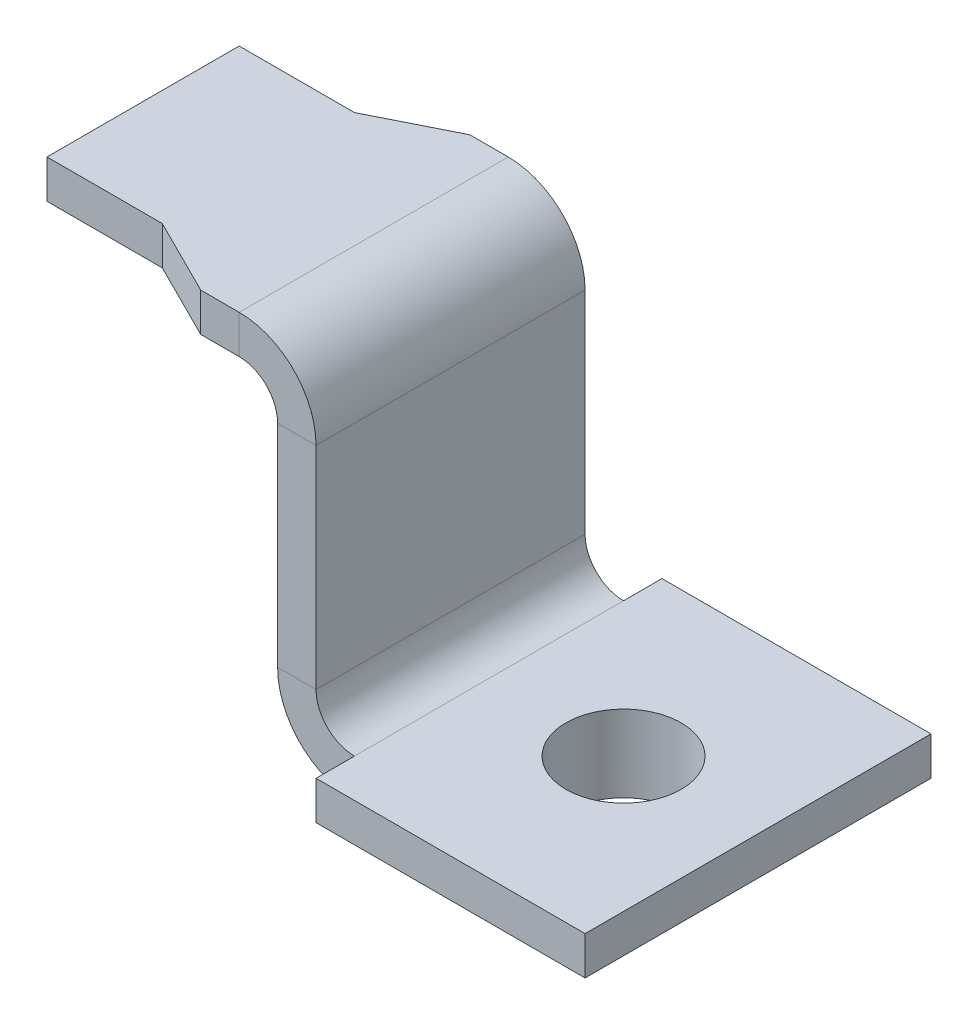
ISO-10303-21;
HEADER;
FILE_DESCRIPTION(('STEP AP214'),'2;1');
FILE_NAME('part.step','',(''),(''),'','','');
FILE_SCHEMA(('AUTOMOTIVE_DESIGN { 1 0 10303 214 1 1 1 1 }'));
ENDSEC;
DATA;
#1=APPLICATION_CONTEXT('core data for automotive mechanical design processes');
#2=APPLICATION_PROTOCOL_DEFINITION('international standard','automotive_design',2000,#1);
#3=PRODUCT_CONTEXT('',#1,'mechanical');
#4=PRODUCT('Part','Part','',(#3));
#5=PRODUCT_RELATED_PRODUCT_CATEGORY('part','',(#4));
#6=PRODUCT_DEFINITION_FORMATION('','',#4);
#7=PRODUCT_DEFINITION_CONTEXT('part definition',#1,'design');
#8=PRODUCT_DEFINITION('design','',#6,#7);
#9=PRODUCT_DEFINITION_SHAPE('','',#8);
#10=(LENGTH_UNIT() NAMED_UNIT(*) SI_UNIT(.MILLI.,.METRE.));
#11=(NAMED_UNIT(*) PLANE_ANGLE_UNIT() SI_UNIT($,.RADIAN.));
#12=(NAMED_UNIT(*) SI_UNIT($,.STERADIAN.) SOLID_ANGLE_UNIT());
#13=UNCERTAINTY_MEASURE_WITH_UNIT(LENGTH_MEASURE(1.E-05),#10,'distance_accuracy_value','');
#14=(GEOMETRIC_REPRESENTATION_CONTEXT(3) GLOBAL_UNCERTAINTY_ASSIGNED_CONTEXT((#13)) GLOBAL_UNIT_ASSIGNED_CONTEXT((#10,
#11,#12)) REPRESENTATION_CONTEXT('',''));
#15=CARTESIAN_POINT('',(0.,0.,0.));
#16=DIRECTION('',(0.,0.,1.));
#17=DIRECTION('',(1.,0.,0.));
#18=AXIS2_PLACEMENT_3D('',#15,#16,#17);
#19=CARTESIAN_POINT('',(-5.50000000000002,8.49999999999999,3.5));
#20=DIRECTION('',(0.,-1.,0.));
#21=DIRECTION('',(0.,0.,-1.));
#22=AXIS2_PLACEMENT_3D('',#19,#20,#21);
#23=PLANE('',#22);
#24=DIRECTION('',(-1.,0.,0.));
#25=VECTOR('',#24,1.);
#26=CARTESIAN_POINT('',(-5.50000000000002,8.49999999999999,3.5));
#27=LINE('',#26,#25);
#28=CARTESIAN_POINT('',(-7.50000000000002,8.49999999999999,3.5));
#29=VERTEX_POINT('',#28);
#30=CARTESIAN_POINT('',(-6.50000000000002,8.49999999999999,3.5));
#31=VERTEX_POINT('',#30);
#32=EDGE_CURVE('E223',#29,#31,#27,.F.);
#33=ORIENTED_EDGE('',*,*,#32,.F.);
#34=DIRECTION('',(0.894427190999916,0.,0.447213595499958));
#35=VECTOR('',#34,1.);
#36=CARTESIAN_POINT('',(-5.90000000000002,8.49999999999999,4.3));
#37=LINE('',#36,#35);
#38=CARTESIAN_POINT('',(-9.50000000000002,8.49999999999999,2.5));
#39=VERTEX_POINT('',#38);
#40=EDGE_CURVE('E83',#39,#29,#37,.T.);
#41=ORIENTED_EDGE('',*,*,#40,.F.);
#42=DIRECTION('',(1.,0.,0.));
#43=VECTOR('',#42,1.);
#44=CARTESIAN_POINT('',(-5.50000000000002,8.49999999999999,2.5));
#45=LINE('',#44,#43);
#46=CARTESIAN_POINT('',(-12.5,8.49999999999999,2.5));
#47=VERTEX_POINT('',#46);
#48=EDGE_CURVE('E198',#47,#39,#45,.T.);
#49=ORIENTED_EDGE('',*,*,#48,.F.);
#50=DIRECTION('',(0.,0.,-1.));
#51=VECTOR('',#50,1.);
#52=CARTESIAN_POINT('',(-12.5,8.49999999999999,3.5));
#53=LINE('',#52,#51);
#54=CARTESIAN_POINT('',(-12.5,8.49999999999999,-2.5));
#55=VERTEX_POINT('',#54);
#56=EDGE_CURVE('E212',#55,#47,#53,.F.);
#57=ORIENTED_EDGE('',*,*,#56,.F.);
#58=DIRECTION('',(-1.,0.,0.));
#59=VECTOR('',#58,1.);
#60=CARTESIAN_POINT('',(-5.50000000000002,8.49999999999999,-2.5));
#61=LINE('',#60,#59);
#62=CARTESIAN_POINT('',(-9.50000000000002,8.49999999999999,-2.5));
#63=VERTEX_POINT('',#62);
#64=EDGE_CURVE('E91',#63,#55,#61,.T.);
#65=ORIENTED_EDGE('',*,*,#64,.F.);
#66=DIRECTION('',(-0.894427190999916,0.,0.447213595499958));
#67=VECTOR('',#66,1.);
#68=CARTESIAN_POINT('',(-8.70000000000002,8.49999999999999,-2.9));
#69=LINE('',#68,#67);
#70=CARTESIAN_POINT('',(-7.50000000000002,8.49999999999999,-3.5));
#71=VERTEX_POINT('',#70);
#72=EDGE_CURVE('E449',#71,#63,#69,.T.);
#73=ORIENTED_EDGE('',*,*,#72,.F.);
#74=DIRECTION('',(1.,0.,0.));
#75=VECTOR('',#74,1.);
#76=CARTESIAN_POINT('',(-12.5,8.49999999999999,-3.5));
#77=LINE('',#76,#75);
#78=CARTESIAN_POINT('',(-6.50000000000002,8.49999999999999,-3.5));
#79=VERTEX_POINT('',#78);
#80=EDGE_CURVE('E218',#79,#71,#77,.F.);
#81=ORIENTED_EDGE('',*,*,#80,.F.);
#82=DIRECTION('',(0.,0.,-1.));
#83=VECTOR('',#82,1.);
#84=CARTESIAN_POINT('',(-6.50000000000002,8.49999999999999,3.5));
#85=LINE('',#84,#83);
#86=EDGE_CURVE('E234',#31,#79,#85,.T.);
#87=ORIENTED_EDGE('',*,*,#86,.F.);
#88=EDGE_LOOP('',(#33,#41,#49,#57,#65,#73,#81,#87));
#89=FACE_BOUND('',#88,.T.);
#90=CARTESIAN_POINT('',(-10.8,8.49999999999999,0.));
#91=DIRECTION('',(0.,-1.,0.));
#92=DIRECTION('',(0.,0.,-1.));
#93=AXIS2_PLACEMENT_3D('',#90,#91,#92);
#94=CIRCLE('',#93,1.5);
#95=CARTESIAN_POINT('',(-10.8,8.49999999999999,-1.5));
#96=VERTEX_POINT('',#95);
#97=EDGE_CURVE('E460',#96,#96,#94,.T.);
#98=ORIENTED_EDGE('',*,*,#97,.F.);
#99=EDGE_LOOP('',(#98));
#100=FACE_BOUND('',#99,.T.);
#101=ADVANCED_FACE('F68',(#89,#100),#23,.T.);
#102=CARTESIAN_POINT('',(-5.50000000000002,9.49999999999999,3.5));
#103=DIRECTION('',(0.,-1.,0.));
#104=DIRECTION('',(0.,0.,-1.));
#105=AXIS2_PLACEMENT_3D('',#102,#103,#104);
#106=PLANE('',#105);
#107=DIRECTION('',(0.894427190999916,0.,0.447213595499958));
#108=VECTOR('',#107,1.);
#109=CARTESIAN_POINT('',(-5.90000000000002,9.49999999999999,4.3));
#110=LINE('',#109,#108);
#111=CARTESIAN_POINT('',(-9.50000000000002,9.49999999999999,2.5));
#112=VERTEX_POINT('',#111);
#113=CARTESIAN_POINT('',(-7.50000000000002,9.49999999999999,3.5));
#114=VERTEX_POINT('',#113);
#115=EDGE_CURVE('E206',#112,#114,#110,.T.);
#116=ORIENTED_EDGE('',*,*,#115,.T.);
#117=DIRECTION('',(1.,0.,0.));
#118=VECTOR('',#117,1.);
#119=CARTESIAN_POINT('',(-5.50000000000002,9.49999999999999,3.5));
#120=LINE('',#119,#118);
#121=CARTESIAN_POINT('',(-6.50000000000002,9.49999999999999,3.5));
#122=VERTEX_POINT('',#121);
#123=EDGE_CURVE('E217',#114,#122,#120,.T.);
#124=ORIENTED_EDGE('',*,*,#123,.T.);
#125=DIRECTION('',(0.,0.,-1.));
#126=VECTOR('',#125,1.);
#127=CARTESIAN_POINT('',(-6.50000000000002,9.49999999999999,3.5));
#128=LINE('',#127,#126);
#129=CARTESIAN_POINT('',(-6.50000000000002,9.49999999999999,-3.5));
#130=VERTEX_POINT('',#129);
#131=EDGE_CURVE('E228',#130,#122,#128,.F.);
#132=ORIENTED_EDGE('',*,*,#131,.F.);
#133=DIRECTION('',(-1.,0.,0.));
#134=VECTOR('',#133,1.);
#135=CARTESIAN_POINT('',(-5.50000000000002,9.49999999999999,-3.5));
#136=LINE('',#135,#134);
#137=CARTESIAN_POINT('',(-7.50000000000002,9.49999999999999,-3.5));
#138=VERTEX_POINT('',#137);
#139=EDGE_CURVE('E220',#130,#138,#136,.T.);
#140=ORIENTED_EDGE('',*,*,#139,.T.);
#141=DIRECTION('',(-0.894427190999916,0.,0.447213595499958));
#142=VECTOR('',#141,1.);
#143=CARTESIAN_POINT('',(-8.70000000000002,9.49999999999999,-2.9));
#144=LINE('',#143,#142);
#145=CARTESIAN_POINT('',(-9.50000000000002,9.49999999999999,-2.5));
#146=VERTEX_POINT('',#145);
#147=EDGE_CURVE('E444',#138,#146,#144,.T.);
#148=ORIENTED_EDGE('',*,*,#147,.T.);
#149=DIRECTION('',(1.,0.,0.));
#150=VECTOR('',#149,1.);
#151=CARTESIAN_POINT('',(-5.50000000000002,9.49999999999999,-2.5));
#152=LINE('',#151,#150);
#153=CARTESIAN_POINT('',(-12.5,9.49999999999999,-2.5));
#154=VERTEX_POINT('',#153);
#155=EDGE_CURVE('E440',#146,#154,#152,.F.);
#156=ORIENTED_EDGE('',*,*,#155,.T.);
#157=DIRECTION('',(0.,0.,1.));
#158=VECTOR('',#157,1.);
#159=CARTESIAN_POINT('',(-12.5,9.49999999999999,3.5));
#160=LINE('',#159,#158);
#161=CARTESIAN_POINT('',(-12.5,9.49999999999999,2.5));
#162=VERTEX_POINT('',#161);
#163=EDGE_CURVE('E247',#154,#162,#160,.T.);
#164=ORIENTED_EDGE('',*,*,#163,.T.);
#165=DIRECTION('',(1.,0.,0.));
#166=VECTOR('',#165,1.);
#167=CARTESIAN_POINT('',(-5.50000000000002,9.49999999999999,2.5));
#168=LINE('',#167,#166);
#169=EDGE_CURVE('E200',#162,#112,#168,.T.);
#170=ORIENTED_EDGE('',*,*,#169,.T.);
#171=EDGE_LOOP('',(#116,#124,#132,#140,#148,#156,#164,#170));
#172=FACE_BOUND('',#171,.T.);
#173=ADVANCED_FACE('F466',(#172),#106,.F.);
#174=CARTESIAN_POINT('',(-12.5,9.49999999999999,3.5));
#175=DIRECTION('',(1.,0.,0.));
#176=DIRECTION('',(0.,1.,0.));
#177=AXIS2_PLACEMENT_3D('',#174,#175,#176);
#178=PLANE('',#177);
#179=DIRECTION('',(0.,-1.,0.));
#180=VECTOR('',#179,1.);
#181=CARTESIAN_POINT('',(-12.5,8.49999999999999,2.5));
#182=LINE('',#181,#180);
#183=EDGE_CURVE('E194',#47,#162,#182,.F.);
#184=ORIENTED_EDGE('',*,*,#183,.T.);
#185=ORIENTED_EDGE('',*,*,#163,.F.);
#186=DIRECTION('',(0.,-1.,0.));
#187=VECTOR('',#186,1.);
#188=CARTESIAN_POINT('',(-12.5,8.49999999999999,-2.5));
#189=LINE('',#188,#187);
#190=EDGE_CURVE('E216',#55,#154,#189,.F.);
#191=ORIENTED_EDGE('',*,*,#190,.F.);
#192=ORIENTED_EDGE('',*,*,#56,.T.);
#193=EDGE_LOOP('',(#184,#185,#191,#192));
#194=FACE_BOUND('',#193,.T.);
#195=ADVANCED_FACE('F215',(#194),#178,.F.);
#196=CARTESIAN_POINT('',(-5.50000000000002,9.49999999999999,3.5));
#197=DIRECTION('',(0.,0.,-1.));
#198=DIRECTION('',(-1.,0.,0.));
#199=AXIS2_PLACEMENT_3D('',#196,#197,#198);
#200=PLANE('',#199);
#201=DIRECTION('',(0.,-1.,0.));
#202=VECTOR('',#201,1.);
#203=CARTESIAN_POINT('',(-7.50000000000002,8.49999999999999,3.5));
#204=LINE('',#203,#202);
#205=EDGE_CURVE('E205',#29,#114,#204,.F.);
#206=ORIENTED_EDGE('',*,*,#205,.F.);
#207=ORIENTED_EDGE('',*,*,#32,.T.);
#208=DIRECTION('',(0.,-1.,0.));
#209=VECTOR('',#208,1.);
#210=CARTESIAN_POINT('',(-6.50000000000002,9.49999999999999,3.5));
#211=LINE('',#210,#209);
#212=EDGE_CURVE('E236',#31,#122,#211,.F.);
#213=ORIENTED_EDGE('',*,*,#212,.T.);
#214=ORIENTED_EDGE('',*,*,#123,.F.);
#215=EDGE_LOOP('',(#206,#207,#213,#214));
#216=FACE_BOUND('',#215,.T.);
#217=ADVANCED_FACE('F412',(#216),#200,.F.);
#218=CARTESIAN_POINT('',(-12.5,9.49999999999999,-3.5));
#219=DIRECTION('',(0.,0.,1.));
#220=DIRECTION('',(1.,0.,0.));
#221=AXIS2_PLACEMENT_3D('',#218,#219,#220);
#222=PLANE('',#221);
#223=DIRECTION('',(0.,-1.,0.));
#224=VECTOR('',#223,1.);
#225=CARTESIAN_POINT('',(-7.50000000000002,8.49999999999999,-3.5));
#226=LINE('',#225,#224);
#227=EDGE_CURVE('E425',#71,#138,#226,.F.);
#228=ORIENTED_EDGE('',*,*,#227,.T.);
#229=ORIENTED_EDGE('',*,*,#139,.F.);
#230=DIRECTION('',(0.,-1.,0.));
#231=VECTOR('',#230,1.);
#232=CARTESIAN_POINT('',(-6.50000000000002,8.49999999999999,-3.5));
#233=LINE('',#232,#231);
#234=EDGE_CURVE('E231',#79,#130,#233,.F.);
#235=ORIENTED_EDGE('',*,*,#234,.F.);
#236=ORIENTED_EDGE('',*,*,#80,.T.);
#237=EDGE_LOOP('',(#228,#229,#235,#236));
#238=FACE_BOUND('',#237,.T.);
#239=ADVANCED_FACE('F423',(#238),#222,.F.);
#240=CARTESIAN_POINT('',(-3.5,0.,4.5));
#241=DIRECTION('',(0.,1.,0.));
#242=DIRECTION('',(0.,0.,1.));
#243=AXIS2_PLACEMENT_3D('',#240,#241,#242);
#244=PLANE('',#243);
#245=CARTESIAN_POINT('',(0.,0.,0.));
#246=DIRECTION('',(0.,1.,0.));
#247=DIRECTION('',(0.,0.,1.));
#248=AXIS2_PLACEMENT_3D('',#245,#246,#247);
#249=CIRCLE('',#248,3.);
#250=CARTESIAN_POINT('',(0.,0.,3.));
#251=VERTEX_POINT('',#250);
#252=EDGE_CURVE('E13',#251,#251,#249,.T.);
#253=ORIENTED_EDGE('',*,*,#252,.T.);
#254=EDGE_LOOP('',(#253));
#255=FACE_BOUND('',#254,.T.);
#256=DIRECTION('',(0.,0.,1.));
#257=VECTOR('',#256,1.);
#258=CARTESIAN_POINT('',(-3.5,0.,-4.5));
#259=LINE('',#258,#257);
#260=CARTESIAN_POINT('',(-3.5,0.,-4.5));
#261=VERTEX_POINT('',#260);
#262=CARTESIAN_POINT('',(-3.5,0.,-3.5));
#263=VERTEX_POINT('',#262);
#264=EDGE_CURVE('E324',#261,#263,#259,.T.);
#265=ORIENTED_EDGE('',*,*,#264,.F.);
#266=DIRECTION('',(-1.,0.,0.));
#267=VECTOR('',#266,1.);
#268=CARTESIAN_POINT('',(-3.5,0.,-4.5));
#269=LINE('',#268,#267);
#270=CARTESIAN_POINT('',(3.5,0.,-4.5));
#271=VERTEX_POINT('',#270);
#272=EDGE_CURVE('E335',#271,#261,#269,.T.);
#273=ORIENTED_EDGE('',*,*,#272,.F.);
#274=DIRECTION('',(0.,0.,-1.));
#275=VECTOR('',#274,1.);
#276=CARTESIAN_POINT('',(3.5,0.,-4.5));
#277=LINE('',#276,#275);
#278=CARTESIAN_POINT('',(3.5,0.,4.5));
#279=VERTEX_POINT('',#278);
#280=EDGE_CURVE('E333',#279,#271,#277,.T.);
#281=ORIENTED_EDGE('',*,*,#280,.F.);
#282=DIRECTION('',(1.,0.,0.));
#283=VECTOR('',#282,1.);
#284=CARTESIAN_POINT('',(-3.5,0.,4.5));
#285=LINE('',#284,#283);
#286=CARTESIAN_POINT('',(-3.5,0.,4.5));
#287=VERTEX_POINT('',#286);
#288=EDGE_CURVE('E327',#287,#279,#285,.T.);
#289=ORIENTED_EDGE('',*,*,#288,.F.);
#290=CARTESIAN_POINT('',(-3.5,0.,3.5));
#291=VERTEX_POINT('',#290);
#292=EDGE_CURVE('E293',#291,#287,#259,.T.);
#293=ORIENTED_EDGE('',*,*,#292,.F.);
#294=DIRECTION('',(0.,0.,1.));
#295=VECTOR('',#294,1.);
#296=CARTESIAN_POINT('',(-3.5,0.,3.5));
#297=LINE('',#296,#295);
#298=EDGE_CURVE('E307',#291,#263,#297,.F.);
#299=ORIENTED_EDGE('',*,*,#298,.T.);
#300=EDGE_LOOP('',(#265,#273,#281,#289,#293,#299));
#301=FACE_BOUND('',#300,.T.);
#302=ADVANCED_FACE('F364',(#255,#301),#244,.F.);
#303=CARTESIAN_POINT('',(-3.5,1.,-4.5));
#304=DIRECTION('',(1.,0.,0.));
#305=DIRECTION('',(0.,0.,-1.));
#306=AXIS2_PLACEMENT_3D('',#303,#304,#305);
#307=PLANE('',#306);
#308=DIRECTION('',(0.,-1.,0.));
#309=VECTOR('',#308,1.);
#310=CARTESIAN_POINT('',(-3.5,0.999999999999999,-3.5));
#311=LINE('',#310,#309);
#312=CARTESIAN_POINT('',(-3.5,0.999999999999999,-3.5));
#313=VERTEX_POINT('',#312);
#314=EDGE_CURVE('E290',#313,#263,#311,.T.);
#315=ORIENTED_EDGE('',*,*,#314,.F.);
#316=DIRECTION('',(0.,0.,1.));
#317=VECTOR('',#316,1.);
#318=CARTESIAN_POINT('',(-3.5,1.,-4.5));
#319=LINE('',#318,#317);
#320=CARTESIAN_POINT('',(-3.5,1.,-4.5));
#321=VERTEX_POINT('',#320);
#322=EDGE_CURVE('E345',#321,#313,#319,.T.);
#323=ORIENTED_EDGE('',*,*,#322,.F.);
#324=DIRECTION('',(0.,-1.,0.));
#325=VECTOR('',#324,1.);
#326=CARTESIAN_POINT('',(-3.5,1.,-4.5));
#327=LINE('',#326,#325);
#328=EDGE_CURVE('E372',#321,#261,#327,.T.);
#329=ORIENTED_EDGE('',*,*,#328,.T.);
#330=ORIENTED_EDGE('',*,*,#264,.T.);
#331=EDGE_LOOP('',(#315,#323,#329,#330));
#332=FACE_BOUND('',#331,.T.);
#333=ADVANCED_FACE('F382',(#332),#307,.F.);
#334=CARTESIAN_POINT('',(-3.5,0.999999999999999,3.5));
#335=VERTEX_POINT('',#334);
#336=CARTESIAN_POINT('',(-3.5,1.,4.5));
#337=VERTEX_POINT('',#336);
#338=EDGE_CURVE('E337',#335,#337,#319,.T.);
#339=ORIENTED_EDGE('',*,*,#338,.F.);
#340=DIRECTION('',(0.,-1.,0.));
#341=VECTOR('',#340,1.);
#342=CARTESIAN_POINT('',(-3.5,0.999999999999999,3.5));
#343=LINE('',#342,#341);
#344=EDGE_CURVE('E294',#335,#291,#343,.T.);
#345=ORIENTED_EDGE('',*,*,#344,.T.);
#346=ORIENTED_EDGE('',*,*,#292,.T.);
#347=DIRECTION('',(0.,-1.,0.));
#348=VECTOR('',#347,1.);
#349=CARTESIAN_POINT('',(-3.5,1.,4.5));
#350=LINE('',#349,#348);
#351=EDGE_CURVE('E310',#337,#287,#350,.T.);
#352=ORIENTED_EDGE('',*,*,#351,.F.);
#353=EDGE_LOOP('',(#339,#345,#346,#352));
#354=FACE_BOUND('',#353,.T.);
#355=ADVANCED_FACE('F70',(#354),#307,.F.);
#356=CARTESIAN_POINT('',(-3.5,1.,4.5));
#357=DIRECTION('',(0.,0.,-1.));
#358=DIRECTION('',(-1.,0.,0.));
#359=AXIS2_PLACEMENT_3D('',#356,#357,#358);
#360=PLANE('',#359);
#361=ORIENTED_EDGE('',*,*,#288,.T.);
#362=DIRECTION('',(0.,-1.,0.));
#363=VECTOR('',#362,1.);
#364=CARTESIAN_POINT('',(3.5,1.,4.5));
#365=LINE('',#364,#363);
#366=CARTESIAN_POINT('',(3.5,1.,4.5));
#367=VERTEX_POINT('',#366);
#368=EDGE_CURVE('E314',#367,#279,#365,.T.);
#369=ORIENTED_EDGE('',*,*,#368,.F.);
#370=DIRECTION('',(1.,0.,0.));
#371=VECTOR('',#370,1.);
#372=CARTESIAN_POINT('',(-3.5,1.,4.5));
#373=LINE('',#372,#371);
#374=EDGE_CURVE('E340',#337,#367,#373,.T.);
#375=ORIENTED_EDGE('',*,*,#374,.F.);
#376=ORIENTED_EDGE('',*,*,#351,.T.);
#377=EDGE_LOOP('',(#361,#369,#375,#376));
#378=FACE_BOUND('',#377,.T.);
#379=ADVANCED_FACE('F356',(#378),#360,.F.);
#380=CARTESIAN_POINT('',(3.5,1.,-4.5));
#381=DIRECTION('',(-1.,0.,0.));
#382=DIRECTION('',(0.,0.,1.));
#383=AXIS2_PLACEMENT_3D('',#380,#381,#382);
#384=PLANE('',#383);
#385=ORIENTED_EDGE('',*,*,#280,.T.);
#386=DIRECTION('',(0.,-1.,0.));
#387=VECTOR('',#386,1.);
#388=CARTESIAN_POINT('',(3.5,1.,-4.5));
#389=LINE('',#388,#387);
#390=CARTESIAN_POINT('',(3.5,1.,-4.5));
#391=VERTEX_POINT('',#390);
#392=EDGE_CURVE('E320',#391,#271,#389,.T.);
#393=ORIENTED_EDGE('',*,*,#392,.F.);
#394=DIRECTION('',(0.,0.,-1.));
#395=VECTOR('',#394,1.);
#396=CARTESIAN_POINT('',(3.5,1.,-4.5));
#397=LINE('',#396,#395);
#398=EDGE_CURVE('E350',#367,#391,#397,.T.);
#399=ORIENTED_EDGE('',*,*,#398,.F.);
#400=ORIENTED_EDGE('',*,*,#368,.T.);
#401=EDGE_LOOP('',(#385,#393,#399,#400));
#402=FACE_BOUND('',#401,.T.);
#403=ADVANCED_FACE('F367',(#402),#384,.F.);
#404=CARTESIAN_POINT('',(-3.5,1.,-4.5));
#405=DIRECTION('',(0.,0.,1.));
#406=DIRECTION('',(1.,0.,0.));
#407=AXIS2_PLACEMENT_3D('',#404,#405,#406);
#408=PLANE('',#407);
#409=ORIENTED_EDGE('',*,*,#272,.T.);
#410=ORIENTED_EDGE('',*,*,#328,.F.);
#411=DIRECTION('',(-1.,0.,0.));
#412=VECTOR('',#411,1.);
#413=CARTESIAN_POINT('',(-3.5,1.,-4.5));
#414=LINE('',#413,#412);
#415=EDGE_CURVE('E371',#391,#321,#414,.T.);
#416=ORIENTED_EDGE('',*,*,#415,.F.);
#417=ORIENTED_EDGE('',*,*,#392,.T.);
#418=EDGE_LOOP('',(#409,#410,#416,#417));
#419=FACE_BOUND('',#418,.T.);
#420=ADVANCED_FACE('F377',(#419),#408,.F.);
#421=CARTESIAN_POINT('',(-3.5,1.,4.5));
#422=DIRECTION('',(0.,1.,0.));
#423=DIRECTION('',(0.,0.,1.));
#424=AXIS2_PLACEMENT_3D('',#421,#422,#423);
#425=PLANE('',#424);
#426=CARTESIAN_POINT('',(0.,1.,0.));
#427=DIRECTION('',(0.,1.,0.));
#428=DIRECTION('',(0.,0.,1.));
#429=AXIS2_PLACEMENT_3D('',#426,#427,#428);
#430=CIRCLE('',#429,1.5);
#431=CARTESIAN_POINT('',(0.,1.,1.5));
#432=VERTEX_POINT('',#431);
#433=EDGE_CURVE('E239',#432,#432,#430,.T.);
#434=ORIENTED_EDGE('',*,*,#433,.F.);
#435=EDGE_LOOP('',(#434));
#436=FACE_BOUND('',#435,.T.);
#437=ORIENTED_EDGE('',*,*,#322,.T.);
#438=DIRECTION('',(0.,0.,1.));
#439=VECTOR('',#438,1.);
#440=CARTESIAN_POINT('',(-3.5,0.999999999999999,3.5));
#441=LINE('',#440,#439);
#442=EDGE_CURVE('E301',#335,#313,#441,.F.);
#443=ORIENTED_EDGE('',*,*,#442,.F.);
#444=ORIENTED_EDGE('',*,*,#338,.T.);
#445=ORIENTED_EDGE('',*,*,#374,.T.);
#446=ORIENTED_EDGE('',*,*,#398,.T.);
#447=ORIENTED_EDGE('',*,*,#415,.T.);
#448=EDGE_LOOP('',(#437,#443,#444,#445,#446,#447));
#449=FACE_BOUND('',#448,.T.);
#450=ADVANCED_FACE('F352',(#436,#449),#425,.T.);
#451=CARTESIAN_POINT('',(-3.5,2.,-3.5));
#452=DIRECTION('',(0.,0.,-1.));
#453=DIRECTION('',(-1.,0.,0.));
#454=AXIS2_PLACEMENT_3D('',#451,#452,#453);
#455=PLANE('',#454);
#456=DIRECTION('',(1.,0.,0.));
#457=VECTOR('',#456,1.);
#458=CARTESIAN_POINT('',(-5.5,1.99999999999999,-3.5));
#459=LINE('',#458,#457);
#460=CARTESIAN_POINT('',(-4.5,2.,-3.5));
#461=VERTEX_POINT('',#460);
#462=CARTESIAN_POINT('',(-5.5,1.99999999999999,-3.5));
#463=VERTEX_POINT('',#462);
#464=EDGE_CURVE('E251',#461,#463,#459,.F.);
#465=ORIENTED_EDGE('',*,*,#464,.F.);
#466=CARTESIAN_POINT('',(-3.5,2.,-3.5));
#467=DIRECTION('',(0.,0.,1.));
#468=DIRECTION('',(1.,0.,0.));
#469=AXIS2_PLACEMENT_3D('',#466,#467,#468);
#470=CIRCLE('',#469,1.);
#471=EDGE_CURVE('E297',#313,#461,#470,.F.);
#472=ORIENTED_EDGE('',*,*,#471,.F.);
#473=ORIENTED_EDGE('',*,*,#314,.T.);
#474=CARTESIAN_POINT('',(-3.5,2.,-3.5));
#475=DIRECTION('',(0.,0.,1.));
#476=DIRECTION('',(1.,0.,0.));
#477=AXIS2_PLACEMENT_3D('',#474,#475,#476);
#478=CIRCLE('',#477,2.);
#479=EDGE_CURVE('E304',#263,#463,#478,.F.);
#480=ORIENTED_EDGE('',*,*,#479,.T.);
#481=EDGE_LOOP('',(#465,#472,#473,#480));
#482=FACE_BOUND('',#481,.T.);
#483=ADVANCED_FACE('F386',(#482),#455,.T.);
#484=CARTESIAN_POINT('',(-3.5,2.,3.5));
#485=DIRECTION('',(0.,0.,-1.));
#486=DIRECTION('',(-1.,0.,0.));
#487=AXIS2_PLACEMENT_3D('',#484,#485,#486);
#488=PLANE('',#487);
#489=CARTESIAN_POINT('',(-3.5,2.,3.5));
#490=DIRECTION('',(0.,0.,1.));
#491=DIRECTION('',(1.,0.,0.));
#492=AXIS2_PLACEMENT_3D('',#489,#490,#491);
#493=CIRCLE('',#492,1.);
#494=CARTESIAN_POINT('',(-4.5,2.,3.5));
#495=VERTEX_POINT('',#494);
#496=EDGE_CURVE('E257',#495,#335,#493,.T.);
#497=ORIENTED_EDGE('',*,*,#496,.F.);
#498=DIRECTION('',(1.,0.,0.));
#499=VECTOR('',#498,1.);
#500=CARTESIAN_POINT('',(-4.5,2.,3.5));
#501=LINE('',#500,#499);
#502=CARTESIAN_POINT('',(-5.5,1.99999999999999,3.5));
#503=VERTEX_POINT('',#502);
#504=EDGE_CURVE('E278',#495,#503,#501,.F.);
#505=ORIENTED_EDGE('',*,*,#504,.T.);
#506=CARTESIAN_POINT('',(-3.5,2.,3.5));
#507=DIRECTION('',(0.,0.,1.));
#508=DIRECTION('',(1.,0.,0.));
#509=AXIS2_PLACEMENT_3D('',#506,#507,#508);
#510=CIRCLE('',#509,2.);
#511=EDGE_CURVE('E300',#503,#291,#510,.T.);
#512=ORIENTED_EDGE('',*,*,#511,.T.);
#513=ORIENTED_EDGE('',*,*,#344,.F.);
#514=EDGE_LOOP('',(#497,#505,#512,#513));
#515=FACE_BOUND('',#514,.T.);
#516=ADVANCED_FACE('F510',(#515),#488,.F.);
#517=CARTESIAN_POINT('',(-3.5,2.,3.5));
#518=DIRECTION('',(0.,0.,1.));
#519=DIRECTION('',(-1.,0.,0.));
#520=AXIS2_PLACEMENT_3D('',#517,#518,#519);
#521=CYLINDRICAL_SURFACE('',#520,2.);
#522=ORIENTED_EDGE('',*,*,#298,.F.);
#523=ORIENTED_EDGE('',*,*,#511,.F.);
#524=DIRECTION('',(0.,0.,1.));
#525=VECTOR('',#524,1.);
#526=CARTESIAN_POINT('',(-5.5,1.99999999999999,-3.5));
#527=LINE('',#526,#525);
#528=EDGE_CURVE('E276',#503,#463,#527,.F.);
#529=ORIENTED_EDGE('',*,*,#528,.T.);
#530=ORIENTED_EDGE('',*,*,#479,.F.);
#531=EDGE_LOOP('',(#522,#523,#529,#530));
#532=FACE_BOUND('',#531,.T.);
#533=ADVANCED_FACE('F388',(#532),#521,.T.);
#534=CARTESIAN_POINT('',(-3.5,2.,3.5));
#535=DIRECTION('',(0.,0.,1.));
#536=DIRECTION('',(-1.,0.,0.));
#537=AXIS2_PLACEMENT_3D('',#534,#535,#536);
#538=CYLINDRICAL_SURFACE('',#537,1.);
#539=ORIENTED_EDGE('',*,*,#442,.T.);
#540=ORIENTED_EDGE('',*,*,#471,.T.);
#541=DIRECTION('',(0.,0.,1.));
#542=VECTOR('',#541,1.);
#543=CARTESIAN_POINT('',(-4.5,2.,-3.5));
#544=LINE('',#543,#542);
#545=EDGE_CURVE('E281',#461,#495,#544,.T.);
#546=ORIENTED_EDGE('',*,*,#545,.T.);
#547=ORIENTED_EDGE('',*,*,#496,.T.);
#548=EDGE_LOOP('',(#539,#540,#546,#547));
#549=FACE_BOUND('',#548,.T.);
#550=ADVANCED_FACE('F505',(#549),#538,.F.);
#551=CARTESIAN_POINT('',(-5.5,0.999999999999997,-3.5));
#552=DIRECTION('',(0.,0.,1.));
#553=DIRECTION('',(1.,0.,0.));
#554=AXIS2_PLACEMENT_3D('',#551,#552,#553);
#555=PLANE('',#554);
#556=ORIENTED_EDGE('',*,*,#464,.T.);
#557=DIRECTION('',(0.,-1.,0.));
#558=VECTOR('',#557,1.);
#559=CARTESIAN_POINT('',(-5.5,0.999999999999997,-3.5));
#560=LINE('',#559,#558);
#561=CARTESIAN_POINT('',(-5.50000000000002,7.5,-3.5));
#562=VERTEX_POINT('',#561);
#563=EDGE_CURVE('E265',#562,#463,#560,.T.);
#564=ORIENTED_EDGE('',*,*,#563,.F.);
#565=DIRECTION('',(1.,0.,0.));
#566=VECTOR('',#565,1.);
#567=CARTESIAN_POINT('',(-5.50000000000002,7.5,-3.5));
#568=LINE('',#567,#566);
#569=CARTESIAN_POINT('',(-4.50000000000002,7.5,-3.5));
#570=VERTEX_POINT('',#569);
#571=EDGE_CURVE('E258',#562,#570,#568,.T.);
#572=ORIENTED_EDGE('',*,*,#571,.T.);
#573=DIRECTION('',(0.,1.,0.));
#574=VECTOR('',#573,1.);
#575=CARTESIAN_POINT('',(-4.5,1.,-3.5));
#576=LINE('',#575,#574);
#577=EDGE_CURVE('E273',#570,#461,#576,.F.);
#578=ORIENTED_EDGE('',*,*,#577,.T.);
#579=EDGE_LOOP('',(#556,#564,#572,#578));
#580=FACE_BOUND('',#579,.T.);
#581=ADVANCED_FACE('F502',(#580),#555,.F.);
#582=CARTESIAN_POINT('',(-5.50000000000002,7.5,3.5));
#583=DIRECTION('',(0.,0.,-1.));
#584=DIRECTION('',(-1.,0.,0.));
#585=AXIS2_PLACEMENT_3D('',#582,#583,#584);
#586=PLANE('',#585);
#587=ORIENTED_EDGE('',*,*,#504,.F.);
#588=DIRECTION('',(0.,-1.,0.));
#589=VECTOR('',#588,1.);
#590=CARTESIAN_POINT('',(-4.50000000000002,7.5,3.5));
#591=LINE('',#590,#589);
#592=CARTESIAN_POINT('',(-4.50000000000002,7.5,3.5));
#593=VERTEX_POINT('',#592);
#594=EDGE_CURVE('E271',#495,#593,#591,.F.);
#595=ORIENTED_EDGE('',*,*,#594,.T.);
#596=DIRECTION('',(1.,0.,0.));
#597=VECTOR('',#596,1.);
#598=CARTESIAN_POINT('',(-5.50000000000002,7.5,3.5));
#599=LINE('',#598,#597);
#600=CARTESIAN_POINT('',(-5.50000000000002,7.5,3.5));
#601=VERTEX_POINT('',#600);
#602=EDGE_CURVE('E254',#601,#593,#599,.T.);
#603=ORIENTED_EDGE('',*,*,#602,.F.);
#604=DIRECTION('',(0.,1.,0.));
#605=VECTOR('',#604,1.);
#606=CARTESIAN_POINT('',(-5.5,0.999999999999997,3.5));
#607=LINE('',#606,#605);
#608=EDGE_CURVE('E263',#503,#601,#607,.T.);
#609=ORIENTED_EDGE('',*,*,#608,.F.);
#610=EDGE_LOOP('',(#587,#595,#603,#609));
#611=FACE_BOUND('',#610,.T.);
#612=ADVANCED_FACE('F397',(#611),#586,.F.);
#613=CARTESIAN_POINT('',(-5.5,0.999999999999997,-3.5));
#614=DIRECTION('',(1.,0.,0.));
#615=DIRECTION('',(0.,1.,0.));
#616=AXIS2_PLACEMENT_3D('',#613,#614,#615);
#617=PLANE('',#616);
#618=ORIENTED_EDGE('',*,*,#528,.F.);
#619=ORIENTED_EDGE('',*,*,#608,.T.);
#620=DIRECTION('',(0.,0.,-1.));
#621=VECTOR('',#620,1.);
#622=CARTESIAN_POINT('',(-5.50000000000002,7.5,-3.5));
#623=LINE('',#622,#621);
#624=EDGE_CURVE('E261',#601,#562,#623,.T.);
#625=ORIENTED_EDGE('',*,*,#624,.T.);
#626=ORIENTED_EDGE('',*,*,#563,.T.);
#627=EDGE_LOOP('',(#618,#619,#625,#626));
#628=FACE_BOUND('',#627,.T.);
#629=ADVANCED_FACE('F392',(#628),#617,.F.);
#630=CARTESIAN_POINT('',(-4.5,1.,-3.5));
#631=DIRECTION('',(1.,0.,0.));
#632=DIRECTION('',(0.,1.,0.));
#633=AXIS2_PLACEMENT_3D('',#630,#631,#632);
#634=PLANE('',#633);
#635=ORIENTED_EDGE('',*,*,#594,.F.);
#636=ORIENTED_EDGE('',*,*,#545,.F.);
#637=ORIENTED_EDGE('',*,*,#577,.F.);
#638=DIRECTION('',(0.,0.,1.));
#639=VECTOR('',#638,1.);
#640=CARTESIAN_POINT('',(-4.50000000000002,7.5,-3.5));
#641=LINE('',#640,#639);
#642=EDGE_CURVE('E268',#593,#570,#641,.F.);
#643=ORIENTED_EDGE('',*,*,#642,.F.);
#644=EDGE_LOOP('',(#635,#636,#637,#643));
#645=FACE_BOUND('',#644,.T.);
#646=ADVANCED_FACE('F492',(#645),#634,.T.);
#647=CARTESIAN_POINT('',(-6.50000000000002,7.49999999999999,3.5));
#648=DIRECTION('',(0.,0.,1.));
#649=DIRECTION('',(1.,0.,0.));
#650=AXIS2_PLACEMENT_3D('',#647,#648,#649);
#651=PLANE('',#650);
#652=ORIENTED_EDGE('',*,*,#212,.F.);
#653=CARTESIAN_POINT('',(-6.50000000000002,7.49999999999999,3.5));
#654=DIRECTION('',(0.,0.,-1.));
#655=DIRECTION('',(-1.,0.,0.));
#656=AXIS2_PLACEMENT_3D('',#653,#654,#655);
#657=CIRCLE('',#656,1.);
#658=EDGE_CURVE('E240',#601,#31,#657,.F.);
#659=ORIENTED_EDGE('',*,*,#658,.F.);
#660=ORIENTED_EDGE('',*,*,#602,.T.);
#661=CARTESIAN_POINT('',(-6.50000000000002,7.49999999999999,3.5));
#662=DIRECTION('',(0.,0.,-1.));
#663=DIRECTION('',(-1.,0.,0.));
#664=AXIS2_PLACEMENT_3D('',#661,#662,#663);
#665=CIRCLE('',#664,2.);
#666=EDGE_CURVE('E248',#593,#122,#665,.F.);
#667=ORIENTED_EDGE('',*,*,#666,.T.);
#668=EDGE_LOOP('',(#652,#659,#660,#667));
#669=FACE_BOUND('',#668,.T.);
#670=ADVANCED_FACE('F409',(#669),#651,.T.);
#671=CARTESIAN_POINT('',(-6.50000000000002,7.49999999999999,-3.5));
#672=DIRECTION('',(0.,0.,1.));
#673=DIRECTION('',(1.,0.,0.));
#674=AXIS2_PLACEMENT_3D('',#671,#672,#673);
#675=PLANE('',#674);
#676=CARTESIAN_POINT('',(-6.50000000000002,7.49999999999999,-3.5));
#677=DIRECTION('',(0.,0.,-1.));
#678=DIRECTION('',(-1.,0.,0.));
#679=AXIS2_PLACEMENT_3D('',#676,#677,#678);
#680=CIRCLE('',#679,1.);
#681=EDGE_CURVE('E244',#79,#562,#680,.T.);
#682=ORIENTED_EDGE('',*,*,#681,.F.);
#683=ORIENTED_EDGE('',*,*,#234,.T.);
#684=CARTESIAN_POINT('',(-6.50000000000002,7.49999999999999,-3.5));
#685=DIRECTION('',(0.,0.,-1.));
#686=DIRECTION('',(-1.,0.,0.));
#687=AXIS2_PLACEMENT_3D('',#684,#685,#686);
#688=CIRCLE('',#687,2.);
#689=EDGE_CURVE('E243',#130,#570,#688,.T.);
#690=ORIENTED_EDGE('',*,*,#689,.T.);
#691=ORIENTED_EDGE('',*,*,#571,.F.);
#692=EDGE_LOOP('',(#682,#683,#690,#691));
#693=FACE_BOUND('',#692,.T.);
#694=ADVANCED_FACE('F418',(#693),#675,.F.);
#695=CARTESIAN_POINT('',(-6.50000000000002,7.49999999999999,-3.5));
#696=DIRECTION('',(0.,0.,-1.));
#697=DIRECTION('',(0.,1.,0.));
#698=AXIS2_PLACEMENT_3D('',#695,#696,#697);
#699=CYLINDRICAL_SURFACE('',#698,2.);
#700=ORIENTED_EDGE('',*,*,#642,.T.);
#701=ORIENTED_EDGE('',*,*,#689,.F.);
#702=ORIENTED_EDGE('',*,*,#131,.T.);
#703=ORIENTED_EDGE('',*,*,#666,.F.);
#704=EDGE_LOOP('',(#700,#701,#702,#703));
#705=FACE_BOUND('',#704,.T.);
#706=ADVANCED_FACE('F486',(#705),#699,.T.);
#707=CARTESIAN_POINT('',(-6.50000000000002,7.49999999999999,-3.5));
#708=DIRECTION('',(0.,0.,-1.));
#709=DIRECTION('',(0.,1.,0.));
#710=AXIS2_PLACEMENT_3D('',#707,#708,#709);
#711=CYLINDRICAL_SURFACE('',#710,1.);
#712=ORIENTED_EDGE('',*,*,#624,.F.);
#713=ORIENTED_EDGE('',*,*,#658,.T.);
#714=ORIENTED_EDGE('',*,*,#86,.T.);
#715=ORIENTED_EDGE('',*,*,#681,.T.);
#716=EDGE_LOOP('',(#712,#713,#714,#715));
#717=FACE_BOUND('',#716,.T.);
#718=ADVANCED_FACE('F405',(#717),#711,.F.);
#719=CARTESIAN_POINT('',(0.,-5.00000000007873E-05,0.));
#720=DIRECTION('',(0.,1.,0.));
#721=DIRECTION('',(0.,0.,1.));
#722=AXIS2_PLACEMENT_3D('',#719,#720,#721);
#723=CYLINDRICAL_SURFACE('',#722,1.5);
#724=ORIENTED_EDGE('',*,*,#433,.T.);
#725=EDGE_LOOP('',(#724));
#726=FACE_BOUND('',#725,.T.);
#727=CARTESIAN_POINT('',(0.,-1.,0.));
#728=DIRECTION('',(0.,-1.,0.));
#729=DIRECTION('',(0.,0.,-1.));
#730=AXIS2_PLACEMENT_3D('',#727,#728,#729);
#731=CIRCLE('',#730,1.5);
#732=CARTESIAN_POINT('',(0.,-1.,-1.5));
#733=VERTEX_POINT('',#732);
#734=EDGE_CURVE('E435',#733,#733,#731,.T.);
#735=ORIENTED_EDGE('',*,*,#734,.T.);
#736=EDGE_LOOP('',(#735));
#737=FACE_BOUND('',#736,.T.);
#738=ADVANCED_FACE('F475',(#726,#737),#723,.F.);
#739=CARTESIAN_POINT('',(0.,-1.,0.));
#740=DIRECTION('',(0.,-1.,0.));
#741=DIRECTION('',(0.,0.,-1.));
#742=AXIS2_PLACEMENT_3D('',#739,#740,#741);
#743=PLANE('',#742);
#744=CARTESIAN_POINT('',(0.,-1.,0.));
#745=DIRECTION('',(0.,-1.,0.));
#746=DIRECTION('',(0.,0.,-1.));
#747=AXIS2_PLACEMENT_3D('',#744,#745,#746);
#748=CIRCLE('',#747,2.5);
#749=CARTESIAN_POINT('',(0.,-1.,-2.5));
#750=VERTEX_POINT('',#749);
#751=EDGE_CURVE('E432',#750,#750,#748,.T.);
#752=ORIENTED_EDGE('',*,*,#751,.T.);
#753=EDGE_LOOP('',(#752));
#754=FACE_BOUND('',#753,.T.);
#755=ORIENTED_EDGE('',*,*,#734,.F.);
#756=EDGE_LOOP('',(#755));
#757=FACE_BOUND('',#756,.T.);
#758=ADVANCED_FACE('F630',(#754,#757),#743,.T.);
#759=CARTESIAN_POINT('',(0.,-1.,0.));
#760=DIRECTION('',(0.,1.,0.));
#761=DIRECTION('',(0.,0.,1.));
#762=AXIS2_PLACEMENT_3D('',#759,#760,#761);
#763=CYLINDRICAL_SURFACE('',#762,2.5);
#764=CARTESIAN_POINT('',(0.,-0.5,0.));
#765=DIRECTION('',(0.,1.,0.));
#766=DIRECTION('',(0.,0.,1.));
#767=AXIS2_PLACEMENT_3D('',#764,#765,#766);
#768=CIRCLE('',#767,2.5);
#769=CARTESIAN_POINT('',(0.,-0.5,2.5));
#770=VERTEX_POINT('',#769);
#771=EDGE_CURVE('E76',#770,#770,#768,.F.);
#772=ORIENTED_EDGE('',*,*,#771,.T.);
#773=EDGE_LOOP('',(#772));
#774=FACE_BOUND('',#773,.T.);
#775=ORIENTED_EDGE('',*,*,#751,.F.);
#776=EDGE_LOOP('',(#775));
#777=FACE_BOUND('',#776,.T.);
#778=ADVANCED_FACE('F718',(#774,#777),#763,.T.);
#779=CARTESIAN_POINT('',(0.,-0.5,0.));
#780=DIRECTION('',(0.,1.,0.));
#781=DIRECTION('',(0.,0.,1.));
#782=AXIS2_PLACEMENT_3D('',#779,#780,#781);
#783=TOROIDAL_SURFACE('',#782,3.,0.5);
#784=ORIENTED_EDGE('',*,*,#252,.F.);
#785=EDGE_LOOP('',(#784));
#786=FACE_BOUND('',#785,.T.);
#787=ORIENTED_EDGE('',*,*,#771,.F.);
#788=EDGE_LOOP('',(#787));
#789=FACE_BOUND('',#788,.T.);
#790=ADVANCED_FACE('F672',(#786,#789),#783,.F.);
#791=CARTESIAN_POINT('',(-5.50000000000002,8.49999999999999,-2.5));
#792=DIRECTION('',(0.,0.,1.));
#793=DIRECTION('',(-1.,0.,0.));
#794=AXIS2_PLACEMENT_3D('',#791,#792,#793);
#795=PLANE('',#794);
#796=DIRECTION('',(0.,-1.,0.));
#797=VECTOR('',#796,1.);
#798=CARTESIAN_POINT('',(-9.50000000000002,8.49999999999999,-2.5));
#799=LINE('',#798,#797);
#800=EDGE_CURVE('E438',#63,#146,#799,.F.);
#801=ORIENTED_EDGE('',*,*,#800,.F.);
#802=ORIENTED_EDGE('',*,*,#64,.T.);
#803=ORIENTED_EDGE('',*,*,#190,.T.);
#804=ORIENTED_EDGE('',*,*,#155,.F.);
#805=EDGE_LOOP('',(#801,#802,#803,#804));
#806=FACE_BOUND('',#805,.T.);
#807=ADVANCED_FACE('F668',(#806),#795,.F.);
#808=CARTESIAN_POINT('',(-8.70000000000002,8.49999999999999,-2.9));
#809=DIRECTION('',(0.447213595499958,0.,0.894427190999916));
#810=DIRECTION('',(-0.894427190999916,0.,0.447213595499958));
#811=AXIS2_PLACEMENT_3D('',#808,#809,#810);
#812=PLANE('',#811);
#813=ORIENTED_EDGE('',*,*,#72,.T.);
#814=ORIENTED_EDGE('',*,*,#800,.T.);
#815=ORIENTED_EDGE('',*,*,#147,.F.);
#816=ORIENTED_EDGE('',*,*,#227,.F.);
#817=EDGE_LOOP('',(#813,#814,#815,#816));
#818=FACE_BOUND('',#817,.T.);
#819=ADVANCED_FACE('F671',(#818),#812,.F.);
#820=CARTESIAN_POINT('',(-5.90000000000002,8.49999999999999,4.3));
#821=DIRECTION('',(0.447213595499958,0.,-0.894427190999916));
#822=DIRECTION('',(0.894427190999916,0.,0.447213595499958));
#823=AXIS2_PLACEMENT_3D('',#820,#821,#822);
#824=PLANE('',#823);
#825=DIRECTION('',(0.,-1.,0.));
#826=VECTOR('',#825,1.);
#827=CARTESIAN_POINT('',(-9.50000000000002,8.49999999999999,2.5));
#828=LINE('',#827,#826);
#829=EDGE_CURVE('E450',#39,#112,#828,.F.);
#830=ORIENTED_EDGE('',*,*,#829,.F.);
#831=ORIENTED_EDGE('',*,*,#40,.T.);
#832=ORIENTED_EDGE('',*,*,#205,.T.);
#833=ORIENTED_EDGE('',*,*,#115,.F.);
#834=EDGE_LOOP('',(#830,#831,#832,#833));
#835=FACE_BOUND('',#834,.T.);
#836=ADVANCED_FACE('F680',(#835),#824,.F.);
#837=CARTESIAN_POINT('',(-5.50000000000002,8.49999999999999,2.5));
#838=DIRECTION('',(0.,0.,-1.));
#839=DIRECTION('',(1.,0.,0.));
#840=AXIS2_PLACEMENT_3D('',#837,#838,#839);
#841=PLANE('',#840);
#842=ORIENTED_EDGE('',*,*,#48,.T.);
#843=ORIENTED_EDGE('',*,*,#829,.T.);
#844=ORIENTED_EDGE('',*,*,#169,.F.);
#845=ORIENTED_EDGE('',*,*,#183,.F.);
#846=EDGE_LOOP('',(#842,#843,#844,#845));
#847=FACE_BOUND('',#846,.T.);
#848=ADVANCED_FACE('F196',(#847),#841,.F.);
#849=CARTESIAN_POINT('',(-10.8,7.99999999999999,0.));
#850=DIRECTION('',(0.,1.,0.));
#851=DIRECTION('',(0.,0.,1.));
#852=AXIS2_PLACEMENT_3D('',#849,#850,#851);
#853=CYLINDRICAL_SURFACE('',#852,1.5);
#854=CARTESIAN_POINT('',(-10.8,7.99999999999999,0.));
#855=DIRECTION('',(0.,-1.,0.));
#856=DIRECTION('',(0.,0.,-1.));
#857=AXIS2_PLACEMENT_3D('',#854,#855,#856);
#858=CIRCLE('',#857,1.5);
#859=CARTESIAN_POINT('',(-10.8,7.99999999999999,-1.5));
#860=VERTEX_POINT('',#859);
#861=EDGE_CURVE('E213',#860,#860,#858,.T.);
#862=ORIENTED_EDGE('',*,*,#861,.F.);
#863=EDGE_LOOP('',(#862));
#864=FACE_BOUND('',#863,.T.);
#865=ORIENTED_EDGE('',*,*,#97,.T.);
#866=EDGE_LOOP('',(#865));
#867=FACE_BOUND('',#866,.T.);
#868=ADVANCED_FACE('F464',(#864,#867),#853,.T.);
#869=CARTESIAN_POINT('',(-10.8,7.99999999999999,0.));
#870=DIRECTION('',(0.,-1.,0.));
#871=DIRECTION('',(0.,0.,-1.));
#872=AXIS2_PLACEMENT_3D('',#869,#870,#871);
#873=PLANE('',#872);
#874=ORIENTED_EDGE('',*,*,#861,.T.);
#875=EDGE_LOOP('',(#874));
#876=FACE_BOUND('',#875,.T.);
#877=ADVANCED_FACE('F705',(#876),#873,.T.);
#878=CLOSED_SHELL('',(#101,#173,#195,#217,#239,#302,#333,#355,#379,#403,#420,#450,#483,#516,
#533,#550,#581,#612,#629,#646,#670,#694,#706,#718,#738,#758,#778,#790,#807,#819,#836,#848,#868,#877));
#879=MANIFOLD_SOLID_BREP('B2',#878);
#880=ADVANCED_BREP_SHAPE_REPRESENTATION('',(#18,#879),#14);
#881=SHAPE_DEFINITION_REPRESENTATION(#9,#880);
ENDSEC;
END-ISO-10303-21;
